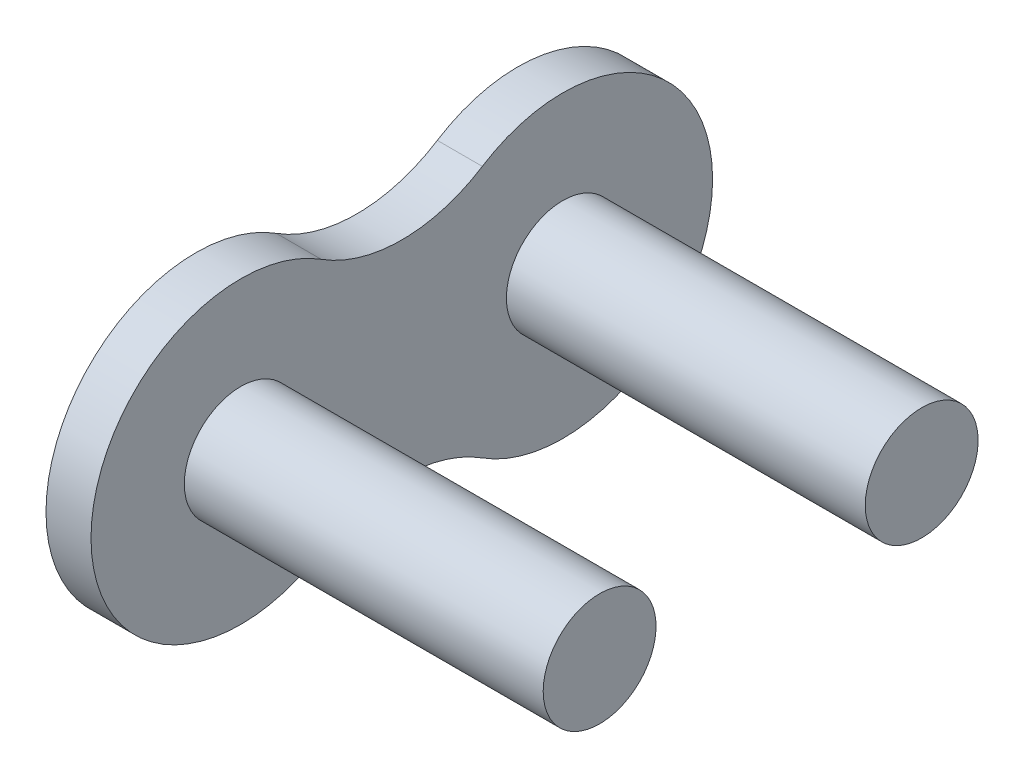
ISO-10303-21;
HEADER;
FILE_DESCRIPTION(('STEP AP214'),'2;1');
FILE_NAME('part.step','',(''),(''),'','','');
FILE_SCHEMA(('AUTOMOTIVE_DESIGN { 1 0 10303 214 1 1 1 1 }'));
ENDSEC;
DATA;
#1=APPLICATION_CONTEXT('core data for automotive mechanical design processes');
#2=APPLICATION_PROTOCOL_DEFINITION('international standard','automotive_design',2000,#1);
#3=PRODUCT_CONTEXT('',#1,'mechanical');
#4=PRODUCT('Part','Part','',(#3));
#5=PRODUCT_RELATED_PRODUCT_CATEGORY('part','',(#4));
#6=PRODUCT_DEFINITION_FORMATION('','',#4);
#7=PRODUCT_DEFINITION_CONTEXT('part definition',#1,'design');
#8=PRODUCT_DEFINITION('design','',#6,#7);
#9=PRODUCT_DEFINITION_SHAPE('','',#8);
#10=(LENGTH_UNIT() NAMED_UNIT(*) SI_UNIT(.MILLI.,.METRE.));
#11=(NAMED_UNIT(*) PLANE_ANGLE_UNIT() SI_UNIT($,.RADIAN.));
#12=(NAMED_UNIT(*) SI_UNIT($,.STERADIAN.) SOLID_ANGLE_UNIT());
#13=UNCERTAINTY_MEASURE_WITH_UNIT(LENGTH_MEASURE(1.E-05),#10,'distance_accuracy_value','');
#14=(GEOMETRIC_REPRESENTATION_CONTEXT(3) GLOBAL_UNCERTAINTY_ASSIGNED_CONTEXT((#13)) GLOBAL_UNIT_ASSIGNED_CONTEXT((#10,
#11,#12)) REPRESENTATION_CONTEXT('',''));
#15=CARTESIAN_POINT('',(0.,0.,0.));
#16=DIRECTION('',(0.,0.,1.));
#17=DIRECTION('',(1.,0.,0.));
#18=AXIS2_PLACEMENT_3D('',#15,#16,#17);
#19=CARTESIAN_POINT('',(230.95845296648,-103.885728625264,46.6500000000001));
#20=DIRECTION('',(-1.,0.,0.));
#21=DIRECTION('',(0.,0.,1.));
#22=AXIS2_PLACEMENT_3D('',#19,#20,#21);
#23=CYLINDRICAL_SURFACE('',#22,2.22500000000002);
#24=CARTESIAN_POINT('',(230.95845296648,-103.885728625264,46.6500000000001));
#25=DIRECTION('',(-1.,0.,0.));
#26=DIRECTION('',(0.,0.,1.));
#27=AXIS2_PLACEMENT_3D('',#24,#25,#26);
#28=CIRCLE('',#27,2.22500000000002);
#29=CARTESIAN_POINT('',(230.95845296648,-103.885728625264,48.8750000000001));
#30=VERTEX_POINT('',#29);
#31=EDGE_CURVE('E10',#30,#30,#28,.T.);
#32=ORIENTED_EDGE('',*,*,#31,.T.);
#33=EDGE_LOOP('',(#32));
#34=FACE_BOUND('',#33,.T.);
#35=CARTESIAN_POINT('',(216.80845296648,-103.885728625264,46.6500000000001));
#36=DIRECTION('',(1.,0.,0.));
#37=DIRECTION('',(0.,1.,0.));
#38=AXIS2_PLACEMENT_3D('',#35,#36,#37);
#39=CIRCLE('',#38,2.22500000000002);
#40=CARTESIAN_POINT('',(216.80845296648,-101.660728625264,46.6500000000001));
#41=VERTEX_POINT('',#40);
#42=EDGE_CURVE('E26',#41,#41,#39,.T.);
#43=ORIENTED_EDGE('',*,*,#42,.T.);
#44=EDGE_LOOP('',(#43));
#45=FACE_BOUND('',#44,.T.);
#46=ADVANCED_FACE('F16',(#34,#45),#23,.T.);
#47=CARTESIAN_POINT('',(230.95845296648,-103.885728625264,46.6500000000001));
#48=DIRECTION('',(-1.,0.,0.));
#49=DIRECTION('',(0.,0.,1.));
#50=AXIS2_PLACEMENT_3D('',#47,#48,#49);
#51=CYLINDRICAL_SURFACE('',#50,2.22500000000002);
#52=CARTESIAN_POINT('',(215.03345296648,-103.885728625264,46.6500000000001));
#53=DIRECTION('',(-1.,0.,0.));
#54=DIRECTION('',(0.,0.,1.));
#55=AXIS2_PLACEMENT_3D('',#52,#53,#54);
#56=CIRCLE('',#55,2.22500000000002);
#57=CARTESIAN_POINT('',(215.03345296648,-103.885728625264,48.8750000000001));
#58=VERTEX_POINT('',#57);
#59=EDGE_CURVE('E155',#58,#58,#56,.T.);
#60=ORIENTED_EDGE('',*,*,#59,.T.);
#61=EDGE_LOOP('',(#60));
#62=FACE_BOUND('',#61,.T.);
#63=CARTESIAN_POINT('',(213.95845296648,-103.885728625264,46.6500000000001));
#64=DIRECTION('',(1.,0.,0.));
#65=DIRECTION('',(0.,1.,0.));
#66=AXIS2_PLACEMENT_3D('',#63,#64,#65);
#67=CIRCLE('',#66,2.22500000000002);
#68=CARTESIAN_POINT('',(213.95845296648,-101.660728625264,46.6500000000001));
#69=VERTEX_POINT('',#68);
#70=EDGE_CURVE('E153',#69,#69,#67,.T.);
#71=ORIENTED_EDGE('',*,*,#70,.T.);
#72=EDGE_LOOP('',(#71));
#73=FACE_BOUND('',#72,.T.);
#74=ADVANCED_FACE('F105',(#62,#73),#51,.T.);
#75=CARTESIAN_POINT('',(230.95845296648,-103.885728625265,59.35));
#76=DIRECTION('',(-1.,0.,0.));
#77=DIRECTION('',(0.,0.,1.));
#78=AXIS2_PLACEMENT_3D('',#75,#76,#77);
#79=CYLINDRICAL_SURFACE('',#78,2.22500000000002);
#80=CARTESIAN_POINT('',(230.95845296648,-103.885728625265,59.35));
#81=DIRECTION('',(-1.,0.,0.));
#82=DIRECTION('',(0.,0.,1.));
#83=AXIS2_PLACEMENT_3D('',#80,#81,#82);
#84=CIRCLE('',#83,2.22500000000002);
#85=CARTESIAN_POINT('',(230.95845296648,-103.885728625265,61.5750000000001));
#86=VERTEX_POINT('',#85);
#87=EDGE_CURVE('E156',#86,#86,#84,.T.);
#88=ORIENTED_EDGE('',*,*,#87,.T.);
#89=EDGE_LOOP('',(#88));
#90=FACE_BOUND('',#89,.T.);
#91=CARTESIAN_POINT('',(216.80845296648,-103.885728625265,59.35));
#92=DIRECTION('',(1.,0.,0.));
#93=DIRECTION('',(0.,1.,0.));
#94=AXIS2_PLACEMENT_3D('',#91,#92,#93);
#95=CIRCLE('',#94,2.22500000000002);
#96=CARTESIAN_POINT('',(216.80845296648,-101.660728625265,59.35));
#97=VERTEX_POINT('',#96);
#98=EDGE_CURVE('E161',#97,#97,#95,.T.);
#99=ORIENTED_EDGE('',*,*,#98,.T.);
#100=EDGE_LOOP('',(#99));
#101=FACE_BOUND('',#100,.T.);
#102=ADVANCED_FACE('F111',(#90,#101),#79,.T.);
#103=CARTESIAN_POINT('',(230.95845296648,-103.885728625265,59.35));
#104=DIRECTION('',(-1.,0.,0.));
#105=DIRECTION('',(0.,0.,1.));
#106=AXIS2_PLACEMENT_3D('',#103,#104,#105);
#107=CYLINDRICAL_SURFACE('',#106,2.22500000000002);
#108=CARTESIAN_POINT('',(215.03345296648,-103.885728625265,59.35));
#109=DIRECTION('',(-1.,0.,0.));
#110=DIRECTION('',(0.,0.,1.));
#111=AXIS2_PLACEMENT_3D('',#108,#109,#110);
#112=CIRCLE('',#111,2.22500000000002);
#113=CARTESIAN_POINT('',(215.03345296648,-103.885728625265,61.5750000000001));
#114=VERTEX_POINT('',#113);
#115=EDGE_CURVE('E167',#114,#114,#112,.T.);
#116=ORIENTED_EDGE('',*,*,#115,.T.);
#117=EDGE_LOOP('',(#116));
#118=FACE_BOUND('',#117,.T.);
#119=CARTESIAN_POINT('',(213.95845296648,-103.885728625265,59.35));
#120=DIRECTION('',(1.,0.,0.));
#121=DIRECTION('',(0.,1.,0.));
#122=AXIS2_PLACEMENT_3D('',#119,#120,#121);
#123=CIRCLE('',#122,2.22500000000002);
#124=CARTESIAN_POINT('',(213.95845296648,-101.660728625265,59.35));
#125=VERTEX_POINT('',#124);
#126=EDGE_CURVE('E92',#125,#125,#123,.T.);
#127=ORIENTED_EDGE('',*,*,#126,.T.);
#128=EDGE_LOOP('',(#127));
#129=FACE_BOUND('',#128,.T.);
#130=ADVANCED_FACE('F121',(#118,#129),#107,.T.);
#131=CARTESIAN_POINT('',(216.80845296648,-97.9807286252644,53.0000000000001));
#132=DIRECTION('',(-1.,0.,0.));
#133=DIRECTION('',(0.,0.,1.));
#134=AXIS2_PLACEMENT_3D('',#131,#132,#133);
#135=PLANE('',#134);
#136=CARTESIAN_POINT('',(216.80845296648,-113.843318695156,53.));
#137=DIRECTION('',(1.,0.,0.));
#138=DIRECTION('',(0.,1.,0.));
#139=AXIS2_PLACEMENT_3D('',#136,#137,#138);
#140=CIRCLE('',#139,5.905);
#141=CARTESIAN_POINT('',(216.80845296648,-108.86452366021,49.8250000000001));
#142=VERTEX_POINT('',#141);
#143=CARTESIAN_POINT('',(216.80845296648,-108.86452366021,56.1750000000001));
#144=VERTEX_POINT('',#143);
#145=EDGE_CURVE('E71',#142,#144,#140,.T.);
#146=ORIENTED_EDGE('',*,*,#145,.F.);
#147=CARTESIAN_POINT('',(216.80845296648,-103.885728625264,46.6500000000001));
#148=DIRECTION('',(-1.,0.,0.));
#149=DIRECTION('',(0.,0.,1.));
#150=AXIS2_PLACEMENT_3D('',#147,#148,#149);
#151=CIRCLE('',#150,5.905);
#152=CARTESIAN_POINT('',(216.80845296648,-98.9069335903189,49.8250000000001));
#153=VERTEX_POINT('',#152);
#154=EDGE_CURVE('E35',#153,#142,#151,.T.);
#155=ORIENTED_EDGE('',*,*,#154,.F.);
#156=CARTESIAN_POINT('',(216.80845296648,-93.9281385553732,53.0000000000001));
#157=DIRECTION('',(1.,0.,0.));
#158=DIRECTION('',(0.,1.,0.));
#159=AXIS2_PLACEMENT_3D('',#156,#157,#158);
#160=CIRCLE('',#159,5.905);
#161=CARTESIAN_POINT('',(216.80845296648,-98.9069335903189,56.1750000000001));
#162=VERTEX_POINT('',#161);
#163=EDGE_CURVE('E86',#162,#153,#160,.T.);
#164=ORIENTED_EDGE('',*,*,#163,.F.);
#165=CARTESIAN_POINT('',(216.80845296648,-103.885728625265,59.35));
#166=DIRECTION('',(1.,0.,0.));
#167=DIRECTION('',(0.,1.,0.));
#168=AXIS2_PLACEMENT_3D('',#165,#166,#167);
#169=CIRCLE('',#168,5.905);
#170=EDGE_CURVE('E90',#162,#144,#169,.T.);
#171=ORIENTED_EDGE('',*,*,#170,.T.);
#172=EDGE_LOOP('',(#146,#155,#164,#171));
#173=FACE_BOUND('',#172,.T.);
#174=ORIENTED_EDGE('',*,*,#42,.F.);
#175=EDGE_LOOP('',(#174));
#176=FACE_BOUND('',#175,.T.);
#177=ORIENTED_EDGE('',*,*,#98,.F.);
#178=EDGE_LOOP('',(#177));
#179=FACE_BOUND('',#178,.T.);
#180=ADVANCED_FACE('F124',(#173,#176,#179),#135,.F.);
#181=CARTESIAN_POINT('',(215.03345296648,-97.9807286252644,53.0000000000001));
#182=DIRECTION('',(-1.,0.,0.));
#183=DIRECTION('',(0.,0.,1.));
#184=AXIS2_PLACEMENT_3D('',#181,#182,#183);
#185=PLANE('',#184);
#186=CARTESIAN_POINT('',(215.03345296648,-93.9281385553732,53.0000000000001));
#187=DIRECTION('',(1.,0.,0.));
#188=DIRECTION('',(0.,1.,0.));
#189=AXIS2_PLACEMENT_3D('',#186,#187,#188);
#190=CIRCLE('',#189,5.905);
#191=CARTESIAN_POINT('',(215.03345296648,-98.9069335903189,56.1750000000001));
#192=VERTEX_POINT('',#191);
#193=CARTESIAN_POINT('',(215.03345296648,-98.9069335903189,49.8250000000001));
#194=VERTEX_POINT('',#193);
#195=EDGE_CURVE('E93',#192,#194,#190,.T.);
#196=ORIENTED_EDGE('',*,*,#195,.T.);
#197=CARTESIAN_POINT('',(215.03345296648,-103.885728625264,46.6500000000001));
#198=DIRECTION('',(-1.,0.,0.));
#199=DIRECTION('',(0.,0.,1.));
#200=AXIS2_PLACEMENT_3D('',#197,#198,#199);
#201=CIRCLE('',#200,5.905);
#202=CARTESIAN_POINT('',(215.03345296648,-108.86452366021,49.8250000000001));
#203=VERTEX_POINT('',#202);
#204=EDGE_CURVE('E75',#194,#203,#201,.T.);
#205=ORIENTED_EDGE('',*,*,#204,.T.);
#206=CARTESIAN_POINT('',(215.03345296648,-113.843318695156,53.));
#207=DIRECTION('',(1.,0.,0.));
#208=DIRECTION('',(0.,1.,0.));
#209=AXIS2_PLACEMENT_3D('',#206,#207,#208);
#210=CIRCLE('',#209,5.905);
#211=CARTESIAN_POINT('',(215.03345296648,-108.86452366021,56.1750000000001));
#212=VERTEX_POINT('',#211);
#213=EDGE_CURVE('E57',#203,#212,#210,.T.);
#214=ORIENTED_EDGE('',*,*,#213,.T.);
#215=CARTESIAN_POINT('',(215.03345296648,-103.885728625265,59.35));
#216=DIRECTION('',(-1.,0.,0.));
#217=DIRECTION('',(0.,0.,1.));
#218=AXIS2_PLACEMENT_3D('',#215,#216,#217);
#219=CIRCLE('',#218,5.905);
#220=EDGE_CURVE('E63',#212,#192,#219,.T.);
#221=ORIENTED_EDGE('',*,*,#220,.T.);
#222=EDGE_LOOP('',(#196,#205,#214,#221));
#223=FACE_BOUND('',#222,.T.);
#224=ORIENTED_EDGE('',*,*,#59,.F.);
#225=EDGE_LOOP('',(#224));
#226=FACE_BOUND('',#225,.T.);
#227=ORIENTED_EDGE('',*,*,#115,.F.);
#228=EDGE_LOOP('',(#227));
#229=FACE_BOUND('',#228,.T.);
#230=ADVANCED_FACE('F73',(#223,#226,#229),#185,.T.);
#231=CARTESIAN_POINT('',(215.92095296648,-113.843318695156,53.));
#232=DIRECTION('',(1.,0.,0.));
#233=DIRECTION('',(0.,1.,0.));
#234=AXIS2_PLACEMENT_3D('',#231,#232,#233);
#235=CYLINDRICAL_SURFACE('',#234,5.90500000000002);
#236=ORIENTED_EDGE('',*,*,#213,.F.);
#237=DIRECTION('',(-1.,0.,0.));
#238=VECTOR('',#237,1.);
#239=CARTESIAN_POINT('',(216.80845296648,-108.86452366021,49.8250000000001));
#240=LINE('',#239,#238);
#241=EDGE_CURVE('E81',#142,#203,#240,.T.);
#242=ORIENTED_EDGE('',*,*,#241,.F.);
#243=ORIENTED_EDGE('',*,*,#145,.T.);
#244=DIRECTION('',(-1.,0.,0.));
#245=VECTOR('',#244,1.);
#246=CARTESIAN_POINT('',(216.80845296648,-108.86452366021,56.1750000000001));
#247=LINE('',#246,#245);
#248=EDGE_CURVE('E66',#144,#212,#247,.T.);
#249=ORIENTED_EDGE('',*,*,#248,.T.);
#250=EDGE_LOOP('',(#236,#242,#243,#249));
#251=FACE_BOUND('',#250,.T.);
#252=ADVANCED_FACE('F77',(#251),#235,.F.);
#253=CARTESIAN_POINT('',(215.92095296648,-103.885728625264,46.6500000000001));
#254=DIRECTION('',(1.,0.,0.));
#255=DIRECTION('',(0.,1.,0.));
#256=AXIS2_PLACEMENT_3D('',#253,#254,#255);
#257=CYLINDRICAL_SURFACE('',#256,5.90500000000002);
#258=ORIENTED_EDGE('',*,*,#204,.F.);
#259=DIRECTION('',(-1.,0.,0.));
#260=VECTOR('',#259,1.);
#261=CARTESIAN_POINT('',(216.80845296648,-98.9069335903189,49.8250000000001));
#262=LINE('',#261,#260);
#263=EDGE_CURVE('E84',#153,#194,#262,.T.);
#264=ORIENTED_EDGE('',*,*,#263,.F.);
#265=ORIENTED_EDGE('',*,*,#154,.T.);
#266=ORIENTED_EDGE('',*,*,#241,.T.);
#267=EDGE_LOOP('',(#258,#264,#265,#266));
#268=FACE_BOUND('',#267,.T.);
#269=ADVANCED_FACE('F96',(#268),#257,.T.);
#270=CARTESIAN_POINT('',(215.92095296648,-93.9281385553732,53.0000000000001));
#271=DIRECTION('',(1.,0.,0.));
#272=DIRECTION('',(0.,1.,0.));
#273=AXIS2_PLACEMENT_3D('',#270,#271,#272);
#274=CYLINDRICAL_SURFACE('',#273,5.90499999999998);
#275=ORIENTED_EDGE('',*,*,#195,.F.);
#276=DIRECTION('',(-1.,0.,0.));
#277=VECTOR('',#276,1.);
#278=CARTESIAN_POINT('',(216.80845296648,-98.9069335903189,56.1750000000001));
#279=LINE('',#278,#277);
#280=EDGE_CURVE('E20',#162,#192,#279,.T.);
#281=ORIENTED_EDGE('',*,*,#280,.F.);
#282=ORIENTED_EDGE('',*,*,#163,.T.);
#283=ORIENTED_EDGE('',*,*,#263,.T.);
#284=EDGE_LOOP('',(#275,#281,#282,#283));
#285=FACE_BOUND('',#284,.T.);
#286=ADVANCED_FACE('F18',(#285),#274,.F.);
#287=CARTESIAN_POINT('',(215.92095296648,-103.885728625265,59.3500000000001));
#288=DIRECTION('',(1.,0.,0.));
#289=DIRECTION('',(0.,1.,0.));
#290=AXIS2_PLACEMENT_3D('',#287,#288,#289);
#291=CYLINDRICAL_SURFACE('',#290,5.90500000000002);
#292=ORIENTED_EDGE('',*,*,#170,.F.);
#293=ORIENTED_EDGE('',*,*,#280,.T.);
#294=ORIENTED_EDGE('',*,*,#220,.F.);
#295=ORIENTED_EDGE('',*,*,#248,.F.);
#296=EDGE_LOOP('',(#292,#293,#294,#295));
#297=FACE_BOUND('',#296,.T.);
#298=ADVANCED_FACE('F65',(#297),#291,.T.);
#299=CARTESIAN_POINT('',(213.95845296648,-103.885728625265,59.35));
#300=DIRECTION('',(-1.,0.,0.));
#301=DIRECTION('',(0.,0.,1.));
#302=AXIS2_PLACEMENT_3D('',#299,#300,#301);
#303=PLANE('',#302);
#304=ORIENTED_EDGE('',*,*,#126,.F.);
#305=EDGE_LOOP('',(#304));
#306=FACE_BOUND('',#305,.T.);
#307=ADVANCED_FACE('F102',(#306),#303,.T.);
#308=CARTESIAN_POINT('',(230.95845296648,-103.885728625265,59.35));
#309=DIRECTION('',(-1.,0.,0.));
#310=DIRECTION('',(0.,0.,1.));
#311=AXIS2_PLACEMENT_3D('',#308,#309,#310);
#312=PLANE('',#311);
#313=ORIENTED_EDGE('',*,*,#87,.F.);
#314=EDGE_LOOP('',(#313));
#315=FACE_BOUND('',#314,.T.);
#316=ADVANCED_FACE('F140',(#315),#312,.F.);
#317=CARTESIAN_POINT('',(213.95845296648,-103.885728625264,46.6500000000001));
#318=DIRECTION('',(-1.,0.,0.));
#319=DIRECTION('',(0.,0.,1.));
#320=AXIS2_PLACEMENT_3D('',#317,#318,#319);
#321=PLANE('',#320);
#322=ORIENTED_EDGE('',*,*,#70,.F.);
#323=EDGE_LOOP('',(#322));
#324=FACE_BOUND('',#323,.T.);
#325=ADVANCED_FACE('F143',(#324),#321,.T.);
#326=CARTESIAN_POINT('',(230.95845296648,-103.885728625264,46.6500000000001));
#327=DIRECTION('',(-1.,0.,0.));
#328=DIRECTION('',(0.,0.,1.));
#329=AXIS2_PLACEMENT_3D('',#326,#327,#328);
#330=PLANE('',#329);
#331=ORIENTED_EDGE('',*,*,#31,.F.);
#332=EDGE_LOOP('',(#331));
#333=FACE_BOUND('',#332,.T.);
#334=ADVANCED_FACE('F117',(#333),#330,.F.);
#335=CLOSED_SHELL('',(#46,#74,#102,#130,#180,#230,#252,#269,#286,#298,#307,#316,#325,#334));
#336=MANIFOLD_SOLID_BREP('B1',#335);
#337=ADVANCED_BREP_SHAPE_REPRESENTATION('',(#18,#336),#14);
#338=SHAPE_DEFINITION_REPRESENTATION(#9,#337);
ENDSEC;
END-ISO-10303-21;
